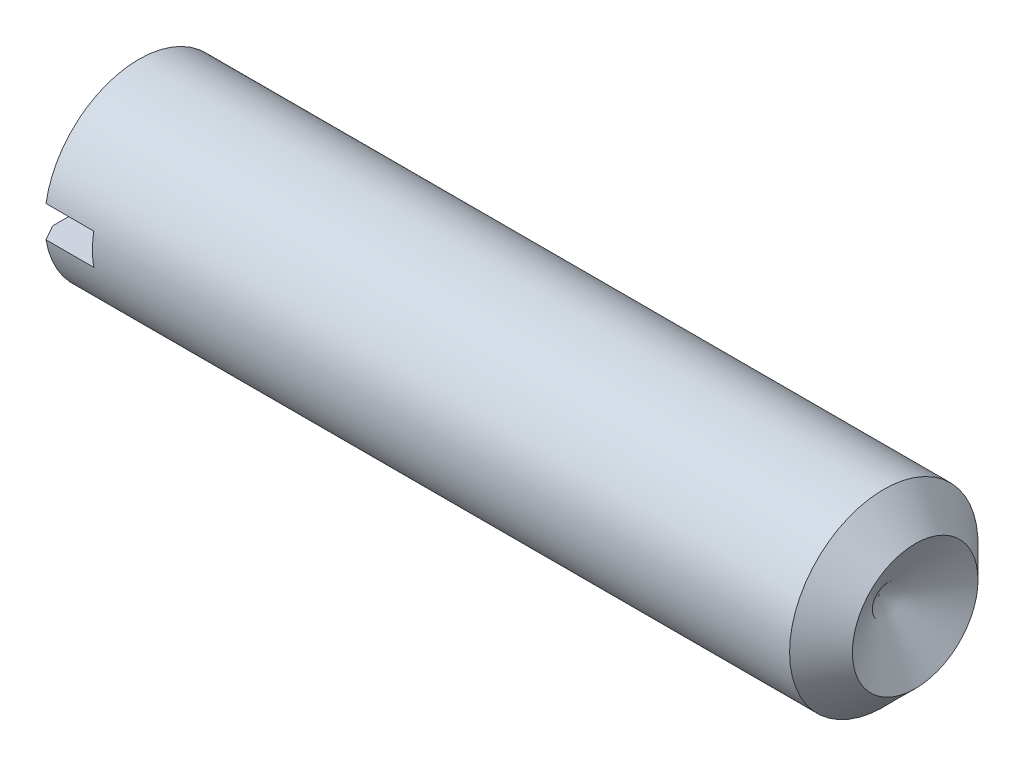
ISO-10303-21;
HEADER;
FILE_DESCRIPTION(('STEP AP214'),'2;1');
FILE_NAME('part.step','',(''),(''),'','','');
FILE_SCHEMA(('AUTOMOTIVE_DESIGN { 1 0 10303 214 1 1 1 1 }'));
ENDSEC;
DATA;
#1=APPLICATION_CONTEXT('core data for automotive mechanical design processes');
#2=APPLICATION_PROTOCOL_DEFINITION('international standard','automotive_design',2000,#1);
#3=PRODUCT_CONTEXT('',#1,'mechanical');
#4=PRODUCT('Part','Part','',(#3));
#5=PRODUCT_RELATED_PRODUCT_CATEGORY('part','',(#4));
#6=PRODUCT_DEFINITION_FORMATION('','',#4);
#7=PRODUCT_DEFINITION_CONTEXT('part definition',#1,'design');
#8=PRODUCT_DEFINITION('design','',#6,#7);
#9=PRODUCT_DEFINITION_SHAPE('','',#8);
#10=(LENGTH_UNIT() NAMED_UNIT(*) SI_UNIT(.MILLI.,.METRE.));
#11=(NAMED_UNIT(*) PLANE_ANGLE_UNIT() SI_UNIT($,.RADIAN.));
#12=(NAMED_UNIT(*) SI_UNIT($,.STERADIAN.) SOLID_ANGLE_UNIT());
#13=UNCERTAINTY_MEASURE_WITH_UNIT(LENGTH_MEASURE(1.E-05),#10,'distance_accuracy_value','');
#14=(GEOMETRIC_REPRESENTATION_CONTEXT(3) GLOBAL_UNCERTAINTY_ASSIGNED_CONTEXT((#13)) GLOBAL_UNIT_ASSIGNED_CONTEXT((#10,
#11,#12)) REPRESENTATION_CONTEXT('',''));
#15=CARTESIAN_POINT('',(0.,0.,0.));
#16=DIRECTION('',(0.,0.,1.));
#17=DIRECTION('',(1.,0.,0.));
#18=AXIS2_PLACEMENT_3D('',#15,#16,#17);
#19=CARTESIAN_POINT('',(0.,0.,0.));
#20=DIRECTION('',(-1.,0.,0.));
#21=DIRECTION('',(0.,0.,1.));
#22=AXIS2_PLACEMENT_3D('',#19,#20,#21);
#23=PLANE('',#22);
#24=CARTESIAN_POINT('',(0.,0.,0.));
#25=DIRECTION('',(-1.,0.,0.));
#26=DIRECTION('',(0.,0.,1.));
#27=AXIS2_PLACEMENT_3D('',#24,#25,#26);
#28=CIRCLE('',#27,5.036);
#29=CARTESIAN_POINT('',(0.,1.,4.93571636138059));
#30=VERTEX_POINT('',#29);
#31=CARTESIAN_POINT('',(0.,1.,-4.93571636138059));
#32=VERTEX_POINT('',#31);
#33=EDGE_CURVE('E117',#30,#32,#28,.T.);
#34=ORIENTED_EDGE('',*,*,#33,.T.);
#35=DIRECTION('',(0.,0.,1.));
#36=VECTOR('',#35,1.);
#37=CARTESIAN_POINT('',(0.,1.,-6.));
#38=LINE('',#37,#36);
#39=EDGE_CURVE('E187',#32,#30,#38,.T.);
#40=ORIENTED_EDGE('',*,*,#39,.T.);
#41=EDGE_LOOP('',(#34,#40));
#42=FACE_BOUND('',#41,.T.);
#43=ADVANCED_FACE('F41',(#42),#23,.T.);
#44=CARTESIAN_POINT('',(0.,-0.999999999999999,-4.93571636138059));
#45=VERTEX_POINT('',#44);
#46=CARTESIAN_POINT('',(0.,-1.,4.93571636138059));
#47=VERTEX_POINT('',#46);
#48=EDGE_CURVE('E112',#45,#47,#28,.T.);
#49=ORIENTED_EDGE('',*,*,#48,.T.);
#50=DIRECTION('',(0.,0.,-1.));
#51=VECTOR('',#50,1.);
#52=CARTESIAN_POINT('',(0.,-0.999999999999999,-6.));
#53=LINE('',#52,#51);
#54=EDGE_CURVE('E106',#47,#45,#53,.T.);
#55=ORIENTED_EDGE('',*,*,#54,.T.);
#56=EDGE_LOOP('',(#49,#55));
#57=FACE_BOUND('',#56,.T.);
#58=ADVANCED_FACE('F178',(#57),#23,.T.);
#59=CARTESIAN_POINT('',(0.,0.,0.));
#60=DIRECTION('',(1.,0.,0.));
#61=DIRECTION('',(0.,0.,-1.));
#62=AXIS2_PLACEMENT_3D('',#59,#60,#61);
#63=CONICAL_SURFACE('',#62,5.036,1.0471975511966);
#64=CARTESIAN_POINT('',(0.5565656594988,0.,0.));
#65=DIRECTION('',(-1.,0.,0.));
#66=DIRECTION('',(0.,0.,1.));
#67=AXIS2_PLACEMENT_3D('',#64,#65,#66);
#68=CIRCLE('',#67,6.);
#69=CARTESIAN_POINT('',(0.5565656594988,0.999999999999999,5.91607978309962));
#70=VERTEX_POINT('',#69);
#71=CARTESIAN_POINT('',(0.5565656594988,1.,-5.91607978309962));
#72=VERTEX_POINT('',#71);
#73=EDGE_CURVE('E111',#70,#72,#68,.T.);
#74=ORIENTED_EDGE('',*,*,#73,.T.);
#75=CARTESIAN_POINT('',(4.73989669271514,1.,-13.2079399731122));
#76=CARTESIAN_POINT('',(4.41853771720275,1.,-12.6497082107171));
#77=CARTESIAN_POINT('',(4.09724308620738,1.,-12.0914392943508));
#78=CARTESIAN_POINT('',(3.45491866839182,1.,-10.9747439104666));
#79=CARTESIAN_POINT('',(3.13388888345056,1.,-10.416317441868));
#80=CARTESIAN_POINT('',(2.49197762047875,1.,-9.29878375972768));
#81=CARTESIAN_POINT('',(2.17109646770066,1.,-8.73967635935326));
#82=CARTESIAN_POINT('',(1.53002759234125,1.,-7.62106803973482));
#83=CARTESIAN_POINT('',(1.2098398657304,1.,-7.0615671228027));
#84=CARTESIAN_POINT('',(0.731752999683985,1.,-6.22374471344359));
#85=CARTESIAN_POINT('',(0.573331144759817,1.,-5.94572157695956));
#86=CARTESIAN_POINT('',(0.25700680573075,1.,-5.38937510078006));
#87=CARTESIAN_POINT('',(0.0991043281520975,1.,-5.11105175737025));
#88=CARTESIAN_POINT('',(-0.215803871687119,1.,-4.5540578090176));
#89=CARTESIAN_POINT('',(-0.372809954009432,1.,-4.27538740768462));
#90=CARTESIAN_POINT('',(-0.685421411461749,1.,-3.71727146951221));
#91=CARTESIAN_POINT('',(-0.841026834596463,1.,-3.43782595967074));
#92=CARTESIAN_POINT('',(-1.07280047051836,1.,-3.01670739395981));
#93=CARTESIAN_POINT('',(-1.15000341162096,1.,-2.87560489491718));
#94=CARTESIAN_POINT('',(-1.30334590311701,1.,-2.59280771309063));
#95=CARTESIAN_POINT('',(-1.37948536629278,1.,-2.45111298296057));
#96=CARTESIAN_POINT('',(-1.53019389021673,1.,-2.16666998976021));
#97=CARTESIAN_POINT('',(-1.60476099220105,1.,-2.02392068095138));
#98=CARTESIAN_POINT('',(-1.71445658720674,1.,-1.80870871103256));
#99=CARTESIAN_POINT('',(-1.75066016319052,1.,-1.73679509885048));
#100=CARTESIAN_POINT('',(-1.82208482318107,1.,-1.59248261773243));
#101=CARTESIAN_POINT('',(-1.85730593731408,1.,-1.52008376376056));
#102=CARTESIAN_POINT('',(-1.92735529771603,1.,-1.37261463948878));
#103=CARTESIAN_POINT('',(-1.96214530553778,1.,-1.29752611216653));
#104=CARTESIAN_POINT('',(-2.02965956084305,1.,-1.1464272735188));
#105=CARTESIAN_POINT('',(-2.06238404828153,1.,-1.07041707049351));
#106=CARTESIAN_POINT('',(-2.12476431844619,1.,-0.917145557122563));
#107=CARTESIAN_POINT('',(-2.15442052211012,1.,-0.83988442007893));
#108=CARTESIAN_POINT('',(-2.20906255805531,1.,-0.683706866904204));
#109=CARTESIAN_POINT('',(-2.23405029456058,1.,-0.604791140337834));
#110=CARTESIAN_POINT('',(-2.2701858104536,1.,-0.470093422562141));
#111=CARTESIAN_POINT('',(-2.28321589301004,1.,-0.414824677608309));
#112=CARTESIAN_POINT('',(-2.3049462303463,1.,-0.303453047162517));
#113=CARTESIAN_POINT('',(-2.31364920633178,1.,-0.247350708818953));
#114=CARTESIAN_POINT('',(-2.32581520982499,1.,-0.134957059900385));
#115=CARTESIAN_POINT('',(-2.32931440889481,1.,-0.0786698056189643));
#116=CARTESIAN_POINT('',(-2.33076867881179,1.,0.0339758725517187));
#117=CARTESIAN_POINT('',(-2.32872385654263,1.,0.0903342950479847));
#118=CARTESIAN_POINT('',(-2.31805799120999,1.,0.217768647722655));
#119=CARTESIAN_POINT('',(-2.30780921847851,1.,0.288706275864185));
#120=CARTESIAN_POINT('',(-2.28041448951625,1.,0.429255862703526));
#121=CARTESIAN_POINT('',(-2.26326048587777,1.,0.498866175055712));
#122=CARTESIAN_POINT('',(-2.2336732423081,1.,0.602653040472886));
#123=CARTESIAN_POINT('',(-2.22308279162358,1.,0.637377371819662));
#124=CARTESIAN_POINT('',(-2.20083833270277,1.,0.706460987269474));
#125=CARTESIAN_POINT('',(-2.18918499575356,1.,0.740820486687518));
#126=CARTESIAN_POINT('',(-2.16499431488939,1.,0.809218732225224));
#127=CARTESIAN_POINT('',(-2.15245710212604,1.,0.843257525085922));
#128=CARTESIAN_POINT('',(-2.12664333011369,1.,0.911058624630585));
#129=CARTESIAN_POINT('',(-2.11336665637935,1.,0.944820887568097));
#130=CARTESIAN_POINT('',(-2.06998388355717,1.,1.05227293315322));
#131=CARTESIAN_POINT('',(-2.03871498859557,1.,1.1254929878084));
#132=CARTESIAN_POINT('',(-1.97418773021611,1.,1.27105481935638));
#133=CARTESIAN_POINT('',(-1.94092900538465,1.,1.34339643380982));
#134=CARTESIAN_POINT('',(-1.87300145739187,1.,1.48745172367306));
#135=CARTESIAN_POINT('',(-1.83833201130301,1.,1.55916510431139));
#136=CARTESIAN_POINT('',(-1.76798292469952,1.,1.7020957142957));
#137=CARTESIAN_POINT('',(-1.73230324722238,1.,1.77331292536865));
#138=CARTESIAN_POINT('',(-1.62404833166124,1.,1.98662313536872));
#139=CARTESIAN_POINT('',(-1.55036430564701,1.,2.12815237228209));
#140=CARTESIAN_POINT('',(-1.40130813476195,1.,2.41025810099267));
#141=CARTESIAN_POINT('',(-1.32593649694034,1.,2.55083486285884));
#142=CARTESIAN_POINT('',(-1.17450983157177,1.,2.83063597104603));
#143=CARTESIAN_POINT('',(-1.0984607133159,1.,2.96986351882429));
#144=CARTESIAN_POINT('',(-0.945628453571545,1.,3.24792809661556));
#145=CARTESIAN_POINT('',(-0.868845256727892,1.,3.38676509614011));
#146=CARTESIAN_POINT('',(-0.637891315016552,1.,3.80258527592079));
#147=CARTESIAN_POINT('',(-0.482967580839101,1.,4.07914988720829));
#148=CARTESIAN_POINT('',(-0.119566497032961,1.,4.72494312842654));
#149=CARTESIAN_POINT('',(0.0893330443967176,0.999999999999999,5.09393352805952));
#150=CARTESIAN_POINT('',(0.50813116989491,0.999999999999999,5.8313517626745));
#151=CARTESIAN_POINT('',(0.718029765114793,0.999999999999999,6.1997795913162));
#152=CARTESIAN_POINT('',(1.13850339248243,0.999999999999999,6.93645171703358));
#153=CARTESIAN_POINT('',(1.34907866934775,0.999999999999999,7.30469587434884));
#154=CARTESIAN_POINT('',(1.77060223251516,0.999999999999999,8.04096877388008));
#155=CARTESIAN_POINT('',(1.98155051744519,0.999999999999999,8.40899751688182));
#156=CARTESIAN_POINT('',(2.40459995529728,0.999999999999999,9.14648067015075));
#157=CARTESIAN_POINT('',(2.61670218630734,0.999999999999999,9.51593446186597));
#158=CARTESIAN_POINT('',(3.04108596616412,0.999999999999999,10.2547396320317));
#159=CARTESIAN_POINT('',(3.25336751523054,0.999999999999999,10.624091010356));
#160=CARTESIAN_POINT('',(3.67796813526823,0.999999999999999,11.3625576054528));
#161=CARTESIAN_POINT('',(3.8902871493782,0.999999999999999,11.7316728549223));
#162=CARTESIAN_POINT('',(4.31502474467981,0.999999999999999,12.4698454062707));
#163=CARTESIAN_POINT('',(4.52744332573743,0.999999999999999,12.8389027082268));
#164=CARTESIAN_POINT('',(4.73989669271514,0.999999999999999,13.2079399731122));
#165=B_SPLINE_CURVE_WITH_KNOTS('',3,(#75,#76,#77,#78,#79,#80,#81,#82,#83,#84,#85,#86,#87,#88,
#89,#90,#91,#92,#93,#94,#95,#96,#97,#98,#99,#100,#101,#102,#103,#104,#105,#106,#107,#108,#109,
#110,#111,#112,#113,#114,#115,#116,#117,#118,#119,#120,#121,#122,#123,#124,#125,#126,#127,#128,
#129,#130,#131,#132,#133,#134,#135,#136,#137,#138,#139,#140,#141,#142,#143,#144,#145,#146,#147,
#148,#149,#150,#151,#152,#153,#154,#155,#156,#157,#158,#159,#160,#161,#162,#163,#164),
.UNSPECIFIED.,.F.,.F.,(4,2,2,2,2,2,2,2,2,2,2,2,2,2,2,2,2,2,2,2,2,2,2,2,2,2,2,2,2,2,2,2,2,2,2,2,
2,2,2,2,2,2,2,2,4),(0.,1.93236881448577,3.86475122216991,5.79868288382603,7.73260327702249,
8.69257649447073,9.65256172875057,10.612129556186,11.5716643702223,12.054187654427,
12.5367502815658,13.019882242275,13.2614145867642,13.5029395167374,13.7511887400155,
13.9994090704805,14.2475953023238,14.4956800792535,14.6658994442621,14.8360116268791,
15.0049357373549,15.1738565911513,15.3884236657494,15.6032415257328,15.7121389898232,
15.8209681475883,15.9297811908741,16.0386111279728,16.2774120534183,16.5162564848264,
16.7552075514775,16.9941673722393,17.4728272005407,17.9513450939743,18.4272722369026,
18.903235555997,19.8542316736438,21.1262890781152,22.3983607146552,23.6709606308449,
24.943555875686,26.2215820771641,27.4996098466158,28.7770795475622,30.0545475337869),.UNSPECIFIED.);
#166=EDGE_CURVE('E136',#72,#32,#165,.T.);
#167=ORIENTED_EDGE('',*,*,#166,.T.);
#168=ORIENTED_EDGE('',*,*,#33,.F.);
#169=EDGE_CURVE('E142',#30,#70,#165,.T.);
#170=ORIENTED_EDGE('',*,*,#169,.T.);
#171=EDGE_LOOP('',(#74,#167,#168,#170));
#172=FACE_BOUND('',#171,.T.);
#173=ADVANCED_FACE('F151',(#172),#63,.T.);
#174=CARTESIAN_POINT('',(0.5565656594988,-0.999999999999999,-5.91607978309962));
#175=VERTEX_POINT('',#174);
#176=CARTESIAN_POINT('',(0.5565656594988,-1.,5.91607978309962));
#177=VERTEX_POINT('',#176);
#178=EDGE_CURVE('E114',#175,#177,#68,.T.);
#179=ORIENTED_EDGE('',*,*,#178,.T.);
#180=CARTESIAN_POINT('',(4.73989669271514,-1.,13.2079399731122));
#181=CARTESIAN_POINT('',(4.41853771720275,-1.,12.649708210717));
#182=CARTESIAN_POINT('',(4.09724308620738,-1.,12.0914392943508));
#183=CARTESIAN_POINT('',(3.45491866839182,-1.,10.9747439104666));
#184=CARTESIAN_POINT('',(3.13388888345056,-1.,10.416317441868));
#185=CARTESIAN_POINT('',(2.49197762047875,-1.,9.29878375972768));
#186=CARTESIAN_POINT('',(2.17109646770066,-1.,8.73967635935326));
#187=CARTESIAN_POINT('',(1.53002759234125,-1.,7.62106803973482));
#188=CARTESIAN_POINT('',(1.2098398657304,-1.,7.0615671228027));
#189=CARTESIAN_POINT('',(0.731752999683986,-1.,6.2237447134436));
#190=CARTESIAN_POINT('',(0.573331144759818,-1.,5.94572157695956));
#191=CARTESIAN_POINT('',(0.257006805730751,-1.,5.38937510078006));
#192=CARTESIAN_POINT('',(0.0991043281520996,-1.,5.11105175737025));
#193=CARTESIAN_POINT('',(-0.215803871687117,-1.,4.55405780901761));
#194=CARTESIAN_POINT('',(-0.372809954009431,-1.,4.27538740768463));
#195=CARTESIAN_POINT('',(-0.685421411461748,-1.,3.71727146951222));
#196=CARTESIAN_POINT('',(-0.841026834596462,-1.,3.43782595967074));
#197=CARTESIAN_POINT('',(-1.07280047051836,-1.,3.01670739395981));
#198=CARTESIAN_POINT('',(-1.15000341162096,-1.,2.87560489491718));
#199=CARTESIAN_POINT('',(-1.30334590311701,-1.,2.59280771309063));
#200=CARTESIAN_POINT('',(-1.37948536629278,-1.,2.45111298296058));
#201=CARTESIAN_POINT('',(-1.53019389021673,-1.,2.16666998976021));
#202=CARTESIAN_POINT('',(-1.60476099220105,-1.,2.02392068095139));
#203=CARTESIAN_POINT('',(-1.71445658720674,-1.,1.80870871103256));
#204=CARTESIAN_POINT('',(-1.75066016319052,-1.,1.73679509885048));
#205=CARTESIAN_POINT('',(-1.82208482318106,-1.,1.59248261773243));
#206=CARTESIAN_POINT('',(-1.85730593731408,-1.,1.52008376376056));
#207=CARTESIAN_POINT('',(-1.92735529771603,-1.,1.37261463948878));
#208=CARTESIAN_POINT('',(-1.96214530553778,-1.,1.29752611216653));
#209=CARTESIAN_POINT('',(-2.02965956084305,-1.,1.1464272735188));
#210=CARTESIAN_POINT('',(-2.06238404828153,-1.,1.07041707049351));
#211=CARTESIAN_POINT('',(-2.12476431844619,-1.,0.917145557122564));
#212=CARTESIAN_POINT('',(-2.15442052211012,-1.,0.839884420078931));
#213=CARTESIAN_POINT('',(-2.2090625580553,-1.,0.683706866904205));
#214=CARTESIAN_POINT('',(-2.23405029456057,-1.,0.604791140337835));
#215=CARTESIAN_POINT('',(-2.2701858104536,-1.,0.470093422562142));
#216=CARTESIAN_POINT('',(-2.28321589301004,-1.,0.41482467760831));
#217=CARTESIAN_POINT('',(-2.3049462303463,-1.,0.303453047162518));
#218=CARTESIAN_POINT('',(-2.31364920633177,-1.,0.247350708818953));
#219=CARTESIAN_POINT('',(-2.32581520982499,-1.,0.134957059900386));
#220=CARTESIAN_POINT('',(-2.32931440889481,-1.,0.0786698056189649));
#221=CARTESIAN_POINT('',(-2.33076867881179,-1.,-0.0339758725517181));
#222=CARTESIAN_POINT('',(-2.32872385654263,-1.,-0.0903342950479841));
#223=CARTESIAN_POINT('',(-2.31805799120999,-1.,-0.217768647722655));
#224=CARTESIAN_POINT('',(-2.30780921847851,-1.,-0.288706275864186));
#225=CARTESIAN_POINT('',(-2.28041448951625,-1.,-0.429255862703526));
#226=CARTESIAN_POINT('',(-2.26326048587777,-1.,-0.498866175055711));
#227=CARTESIAN_POINT('',(-2.2336732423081,-1.,-0.602653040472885));
#228=CARTESIAN_POINT('',(-2.22308279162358,-1.,-0.637377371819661));
#229=CARTESIAN_POINT('',(-2.20083833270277,-1.,-0.706460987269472));
#230=CARTESIAN_POINT('',(-2.18918499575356,-1.,-0.740820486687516));
#231=CARTESIAN_POINT('',(-2.16499431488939,-1.,-0.809218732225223));
#232=CARTESIAN_POINT('',(-2.15245710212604,-1.,-0.843257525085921));
#233=CARTESIAN_POINT('',(-2.12664333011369,-1.,-0.911058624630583));
#234=CARTESIAN_POINT('',(-2.11336665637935,-1.,-0.944820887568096));
#235=CARTESIAN_POINT('',(-2.06998388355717,-1.,-1.05227293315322));
#236=CARTESIAN_POINT('',(-2.03871498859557,-1.,-1.12549298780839));
#237=CARTESIAN_POINT('',(-1.97418773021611,-1.,-1.27105481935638));
#238=CARTESIAN_POINT('',(-1.94092900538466,-1.,-1.34339643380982));
#239=CARTESIAN_POINT('',(-1.87300145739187,-1.,-1.48745172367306));
#240=CARTESIAN_POINT('',(-1.83833201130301,-1.,-1.55916510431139));
#241=CARTESIAN_POINT('',(-1.76798292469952,-1.,-1.7020957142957));
#242=CARTESIAN_POINT('',(-1.73230324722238,-1.,-1.77331292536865));
#243=CARTESIAN_POINT('',(-1.62404833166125,-1.,-1.98662313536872));
#244=CARTESIAN_POINT('',(-1.55036430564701,-1.,-2.12815237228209));
#245=CARTESIAN_POINT('',(-1.40130813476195,-1.,-2.41025810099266));
#246=CARTESIAN_POINT('',(-1.32593649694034,-1.,-2.55083486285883));
#247=CARTESIAN_POINT('',(-1.17450983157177,-1.,-2.83063597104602));
#248=CARTESIAN_POINT('',(-1.09846071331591,-1.,-2.96986351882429));
#249=CARTESIAN_POINT('',(-0.945628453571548,-1.,-3.24792809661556));
#250=CARTESIAN_POINT('',(-0.868845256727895,-1.,-3.3867650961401));
#251=CARTESIAN_POINT('',(-0.637891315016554,-0.999999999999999,-3.80258527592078));
#252=CARTESIAN_POINT('',(-0.482967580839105,-1.,-4.07914988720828));
#253=CARTESIAN_POINT('',(-0.119566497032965,-1.,-4.72494312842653));
#254=CARTESIAN_POINT('',(0.0893330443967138,-0.999999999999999,-5.09393352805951));
#255=CARTESIAN_POINT('',(0.508131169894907,-0.999999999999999,-5.83135176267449));
#256=CARTESIAN_POINT('',(0.718029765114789,-0.999999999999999,-6.1997795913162));
#257=CARTESIAN_POINT('',(1.13850339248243,-0.999999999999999,-6.93645171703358));
#258=CARTESIAN_POINT('',(1.34907866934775,-0.999999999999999,-7.30469587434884));
#259=CARTESIAN_POINT('',(1.77060223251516,-0.999999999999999,-8.04096877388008));
#260=CARTESIAN_POINT('',(1.98155051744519,-0.999999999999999,-8.40899751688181));
#261=CARTESIAN_POINT('',(2.40459995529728,-0.999999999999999,-9.14648067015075));
#262=CARTESIAN_POINT('',(2.61670218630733,-0.999999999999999,-9.51593446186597));
#263=CARTESIAN_POINT('',(3.04108596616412,-0.999999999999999,-10.2547396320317));
#264=CARTESIAN_POINT('',(3.25336751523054,-0.999999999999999,-10.624091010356));
#265=CARTESIAN_POINT('',(3.67796813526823,-0.999999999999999,-11.3625576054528));
#266=CARTESIAN_POINT('',(3.8902871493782,-0.999999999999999,-11.7316728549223));
#267=CARTESIAN_POINT('',(4.31502474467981,-0.999999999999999,-12.4698454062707));
#268=CARTESIAN_POINT('',(4.52744332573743,-0.999999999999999,-12.8389027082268));
#269=CARTESIAN_POINT('',(4.73989669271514,-0.999999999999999,-13.2079399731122));
#270=B_SPLINE_CURVE_WITH_KNOTS('',3,(#180,#181,#182,#183,#184,#185,#186,#187,#188,#189,#190,
#191,#192,#193,#194,#195,#196,#197,#198,#199,#200,#201,#202,#203,#204,#205,#206,#207,#208,#209,
#210,#211,#212,#213,#214,#215,#216,#217,#218,#219,#220,#221,#222,#223,#224,#225,#226,#227,#228,
#229,#230,#231,#232,#233,#234,#235,#236,#237,#238,#239,#240,#241,#242,#243,#244,#245,#246,#247,
#248,#249,#250,#251,#252,#253,#254,#255,#256,#257,#258,#259,#260,#261,#262,#263,#264,#265,#266,
#267,#268,#269),.UNSPECIFIED.,.F.,.F.,(4,2,2,2,2,2,2,2,2,2,2,2,2,2,2,2,2,2,2,2,2,2,2,2,2,2,2,2,
2,2,2,2,2,2,2,2,2,2,2,2,2,2,2,2,4),(0.,1.93236881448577,3.86475122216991,5.79868288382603,
7.73260327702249,8.69257649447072,9.65256172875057,10.612129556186,11.5716643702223,
12.054187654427,12.5367502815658,13.019882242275,13.2614145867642,13.5029395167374,
13.7511887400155,13.9994090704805,14.2475953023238,14.4956800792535,14.6658994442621,
14.8360116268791,15.0049357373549,15.1738565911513,15.3884236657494,15.6032415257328,
15.7121389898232,15.8209681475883,15.9297811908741,16.0386111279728,16.2774120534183,
16.5162564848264,16.7552075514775,16.9941673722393,17.4728272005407,17.9513450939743,
18.4272722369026,18.903235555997,19.8542316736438,21.1262890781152,22.3983607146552,
23.6709606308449,24.943555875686,26.2215820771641,27.4996098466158,28.7770795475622,
30.0545475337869),.UNSPECIFIED.);
#271=EDGE_CURVE('E137',#177,#47,#270,.T.);
#272=ORIENTED_EDGE('',*,*,#271,.T.);
#273=ORIENTED_EDGE('',*,*,#48,.F.);
#274=EDGE_CURVE('E140',#45,#175,#270,.T.);
#275=ORIENTED_EDGE('',*,*,#274,.T.);
#276=EDGE_LOOP('',(#179,#272,#273,#275));
#277=FACE_BOUND('',#276,.T.);
#278=ADVANCED_FACE('F134',(#277),#63,.T.);
#279=CARTESIAN_POINT('',(-12.7,0.,0.));
#280=DIRECTION('',(-1.,0.,0.));
#281=DIRECTION('',(0.,0.,1.));
#282=AXIS2_PLACEMENT_3D('',#279,#280,#281);
#283=CYLINDRICAL_SURFACE('',#282,6.);
#284=CARTESIAN_POINT('',(48.,0.,0.));
#285=DIRECTION('',(-1.,0.,0.));
#286=DIRECTION('',(0.,0.,1.));
#287=AXIS2_PLACEMENT_3D('',#284,#285,#286);
#288=CIRCLE('',#287,6.);
#289=CARTESIAN_POINT('',(48.,0.,6.));
#290=VERTEX_POINT('',#289);
#291=EDGE_CURVE('E122',#290,#290,#288,.T.);
#292=ORIENTED_EDGE('',*,*,#291,.T.);
#293=EDGE_LOOP('',(#292));
#294=FACE_BOUND('',#293,.T.);
#295=ORIENTED_EDGE('',*,*,#73,.F.);
#296=DIRECTION('',(-1.,0.,0.));
#297=VECTOR('',#296,1.);
#298=CARTESIAN_POINT('',(-12.7,0.999999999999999,5.91607978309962));
#299=LINE('',#298,#297);
#300=CARTESIAN_POINT('',(3.6,0.999999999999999,5.91607978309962));
#301=VERTEX_POINT('',#300);
#302=EDGE_CURVE('E11',#70,#301,#299,.F.);
#303=ORIENTED_EDGE('',*,*,#302,.T.);
#304=CARTESIAN_POINT('',(3.6,0.,0.));
#305=DIRECTION('',(1.,0.,0.));
#306=DIRECTION('',(0.,0.,-1.));
#307=AXIS2_PLACEMENT_3D('',#304,#305,#306);
#308=CIRCLE('',#307,6.);
#309=CARTESIAN_POINT('',(3.6,-1.,5.91607978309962));
#310=VERTEX_POINT('',#309);
#311=EDGE_CURVE('E92',#310,#301,#308,.F.);
#312=ORIENTED_EDGE('',*,*,#311,.F.);
#313=DIRECTION('',(-1.,0.,0.));
#314=VECTOR('',#313,1.);
#315=CARTESIAN_POINT('',(-12.7,-1.,5.91607978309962));
#316=LINE('',#315,#314);
#317=EDGE_CURVE('E48',#310,#177,#316,.T.);
#318=ORIENTED_EDGE('',*,*,#317,.T.);
#319=ORIENTED_EDGE('',*,*,#178,.F.);
#320=DIRECTION('',(-1.,0.,0.));
#321=VECTOR('',#320,1.);
#322=CARTESIAN_POINT('',(-12.7,-0.999999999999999,-5.91607978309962));
#323=LINE('',#322,#321);
#324=CARTESIAN_POINT('',(3.6,-0.999999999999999,-5.91607978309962));
#325=VERTEX_POINT('',#324);
#326=EDGE_CURVE('E129',#175,#325,#323,.F.);
#327=ORIENTED_EDGE('',*,*,#326,.T.);
#328=CARTESIAN_POINT('',(3.6,1.,-5.91607978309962));
#329=VERTEX_POINT('',#328);
#330=EDGE_CURVE('E99',#329,#325,#308,.F.);
#331=ORIENTED_EDGE('',*,*,#330,.F.);
#332=DIRECTION('',(-1.,0.,0.));
#333=VECTOR('',#332,1.);
#334=CARTESIAN_POINT('',(-12.7,1.,-5.91607978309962));
#335=LINE('',#334,#333);
#336=EDGE_CURVE('E96',#329,#72,#335,.T.);
#337=ORIENTED_EDGE('',*,*,#336,.T.);
#338=EDGE_LOOP('',(#295,#303,#312,#318,#319,#327,#331,#337));
#339=FACE_BOUND('',#338,.T.);
#340=ADVANCED_FACE('F107',(#294,#339),#283,.T.);
#341=CARTESIAN_POINT('',(50.,0.,0.));
#342=DIRECTION('',(-1.,0.,0.));
#343=DIRECTION('',(0.,0.,1.));
#344=AXIS2_PLACEMENT_3D('',#341,#342,#343);
#345=CONICAL_SURFACE('',#344,4.,0.785398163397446);
#346=ORIENTED_EDGE('',*,*,#291,.F.);
#347=EDGE_LOOP('',(#346));
#348=FACE_BOUND('',#347,.T.);
#349=CARTESIAN_POINT('',(50.,0.,0.));
#350=DIRECTION('',(-1.,0.,0.));
#351=DIRECTION('',(0.,0.,1.));
#352=AXIS2_PLACEMENT_3D('',#349,#350,#351);
#353=CIRCLE('',#352,4.);
#354=CARTESIAN_POINT('',(50.,0.,4.));
#355=VERTEX_POINT('',#354);
#356=EDGE_CURVE('E189',#355,#355,#353,.T.);
#357=ORIENTED_EDGE('',*,*,#356,.T.);
#358=EDGE_LOOP('',(#357));
#359=FACE_BOUND('',#358,.T.);
#360=ADVANCED_FACE('F166',(#348,#359),#345,.T.);
#361=CARTESIAN_POINT('',(50.,0.,0.));
#362=DIRECTION('',(1.,0.,0.));
#363=DIRECTION('',(0.,0.,-1.));
#364=AXIS2_PLACEMENT_3D('',#361,#362,#363);
#365=CONICAL_SURFACE('',#364,4.,1.0471975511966);
#366=CARTESIAN_POINT('',(47.6905989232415,0.,0.));
#367=VERTEX_POINT('',#366);
#368=VERTEX_LOOP('',#367);
#369=FACE_BOUND('',#368,.T.);
#370=ORIENTED_EDGE('',*,*,#356,.F.);
#371=EDGE_LOOP('',(#370));
#372=FACE_BOUND('',#371,.T.);
#373=ADVANCED_FACE('F164',(#369,#372),#365,.F.);
#374=CARTESIAN_POINT('',(3.6,1.,-6.));
#375=DIRECTION('',(0.,-1.,0.));
#376=DIRECTION('',(0.,0.,-1.));
#377=AXIS2_PLACEMENT_3D('',#374,#375,#376);
#378=PLANE('',#377);
#379=ORIENTED_EDGE('',*,*,#39,.F.);
#380=ORIENTED_EDGE('',*,*,#166,.F.);
#381=ORIENTED_EDGE('',*,*,#336,.F.);
#382=DIRECTION('',(0.,0.,1.));
#383=VECTOR('',#382,1.);
#384=CARTESIAN_POINT('',(3.6,1.,-6.));
#385=LINE('',#384,#383);
#386=EDGE_CURVE('E54',#329,#301,#385,.T.);
#387=ORIENTED_EDGE('',*,*,#386,.T.);
#388=ORIENTED_EDGE('',*,*,#302,.F.);
#389=ORIENTED_EDGE('',*,*,#169,.F.);
#390=EDGE_LOOP('',(#379,#380,#381,#387,#388,#389));
#391=FACE_BOUND('',#390,.T.);
#392=ADVANCED_FACE('F105',(#391),#378,.T.);
#393=CARTESIAN_POINT('',(3.6,-0.999999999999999,-6.));
#394=DIRECTION('',(0.,1.,0.));
#395=DIRECTION('',(0.,0.,1.));
#396=AXIS2_PLACEMENT_3D('',#393,#394,#395);
#397=PLANE('',#396);
#398=ORIENTED_EDGE('',*,*,#54,.F.);
#399=ORIENTED_EDGE('',*,*,#271,.F.);
#400=ORIENTED_EDGE('',*,*,#317,.F.);
#401=DIRECTION('',(0.,0.,-1.));
#402=VECTOR('',#401,1.);
#403=CARTESIAN_POINT('',(3.6,-0.999999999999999,-6.));
#404=LINE('',#403,#402);
#405=EDGE_CURVE('E91',#310,#325,#404,.T.);
#406=ORIENTED_EDGE('',*,*,#405,.T.);
#407=ORIENTED_EDGE('',*,*,#326,.F.);
#408=ORIENTED_EDGE('',*,*,#274,.F.);
#409=EDGE_LOOP('',(#398,#399,#400,#406,#407,#408));
#410=FACE_BOUND('',#409,.T.);
#411=ADVANCED_FACE('F159',(#410),#397,.T.);
#412=CARTESIAN_POINT('',(3.6,1.,-6.));
#413=DIRECTION('',(1.,0.,0.));
#414=DIRECTION('',(0.,0.,-1.));
#415=AXIS2_PLACEMENT_3D('',#412,#413,#414);
#416=PLANE('',#415);
#417=ORIENTED_EDGE('',*,*,#405,.F.);
#418=ORIENTED_EDGE('',*,*,#311,.T.);
#419=ORIENTED_EDGE('',*,*,#386,.F.);
#420=ORIENTED_EDGE('',*,*,#330,.T.);
#421=EDGE_LOOP('',(#417,#418,#419,#420));
#422=FACE_BOUND('',#421,.T.);
#423=ADVANCED_FACE('F95',(#422),#416,.F.);
#424=CLOSED_SHELL('',(#43,#58,#173,#278,#340,#360,#373,#392,#411,#423));
#425=MANIFOLD_SOLID_BREP('B2',#424);
#426=ADVANCED_BREP_SHAPE_REPRESENTATION('',(#18,#425),#14);
#427=SHAPE_DEFINITION_REPRESENTATION(#9,#426);
ENDSEC;
END-ISO-10303-21;
